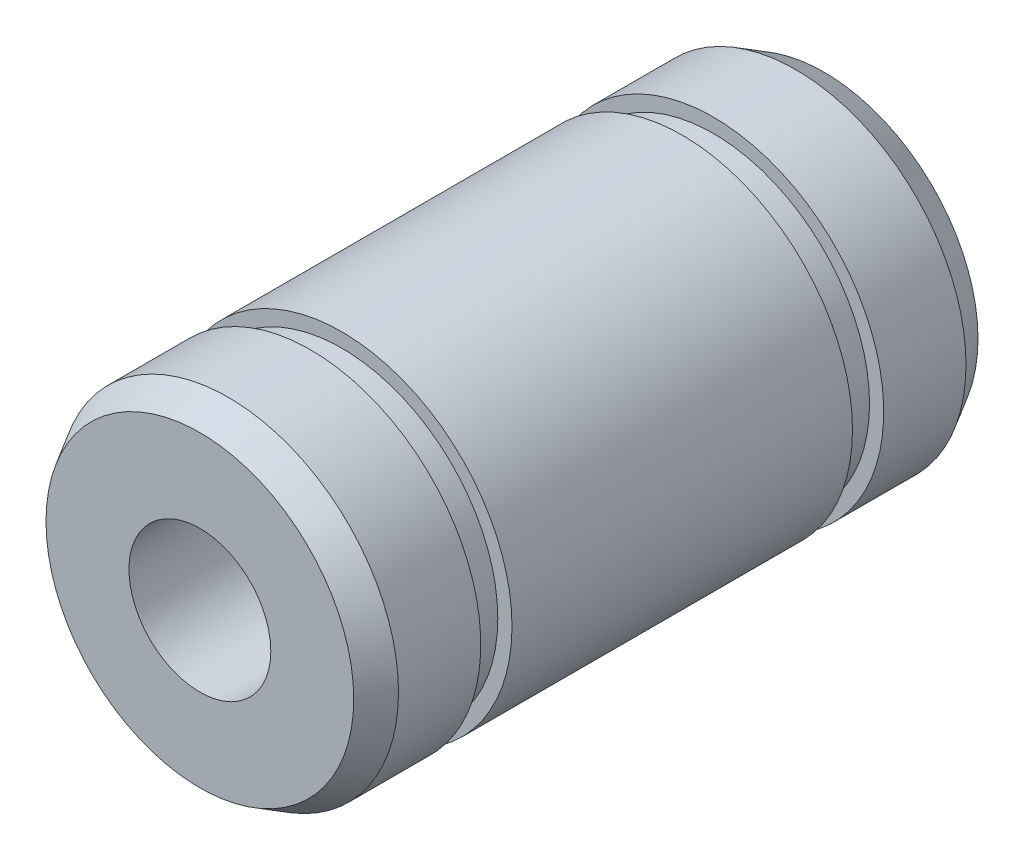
from build123d import *

# Parameters (mm, degrees)
ESQUISSE1_R      = 6
ESQUISSE1_R_2    = 2.5
EXTRUSION1_DEPTH = 11
CHANFREIN1_SIZE  = 1
CHANFREIN1_SIZE2 = 0.577350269
ESQUISSE2_W      = 1.1
ESQUISSE2_H      = 10


with BuildPart() as part:
    # Esquisse1 → Extrusion1 (new body)
    with BuildSketch(Plane.XY):
        Circle(ESQUISSE1_R)
        Circle(ESQUISSE1_R_2, mode=Mode.SUBTRACT)
    extrude(amount=EXTRUSION1_DEPTH)

    # Chanfrein1
    chanfrein1_edges = [part.edges().sort_by_distance(p)[0] for p in [
        (-6, 0, 11),
    ]]
    chanfrein1_side = [part.faces().sort_by_distance(p)[0] for p in [
        (-6, 0, 5.5),
    ]]
    chamfer(chanfrein1_edges, length=CHANFREIN1_SIZE, length2=CHANFREIN1_SIZE2, reference=chanfrein1_side[0])

    # Esquisse2 → Enl_vement de mati_re-R_volution1 (revolve, cut)
    with BuildSketch(Plane(origin=(0, 0, 0), x_dir=(0, 0, -1), z_dir=(1, 0, 0)), mode=Mode.PRIVATE) as enl_vement_de_mati_re_r_volution1_sk:
        with Locations((-6.55, 10.5)):
            Rectangle(ESQUISSE2_W, ESQUISSE2_H)
    revolve(enl_vement_de_mati_re_r_volution1_sk.sketch.rotate(Axis((0, 0, 11), (0, 0, -1)), 90), axis=Axis((0, 0, 11), (0, 0, -1)), mode=Mode.SUBTRACT)

    # Sym_trie1: part across plane


with BuildPart() as part_1:
    add(part.part)
    add(part.part.mirror(Plane.XY))


solid = part_1.part
